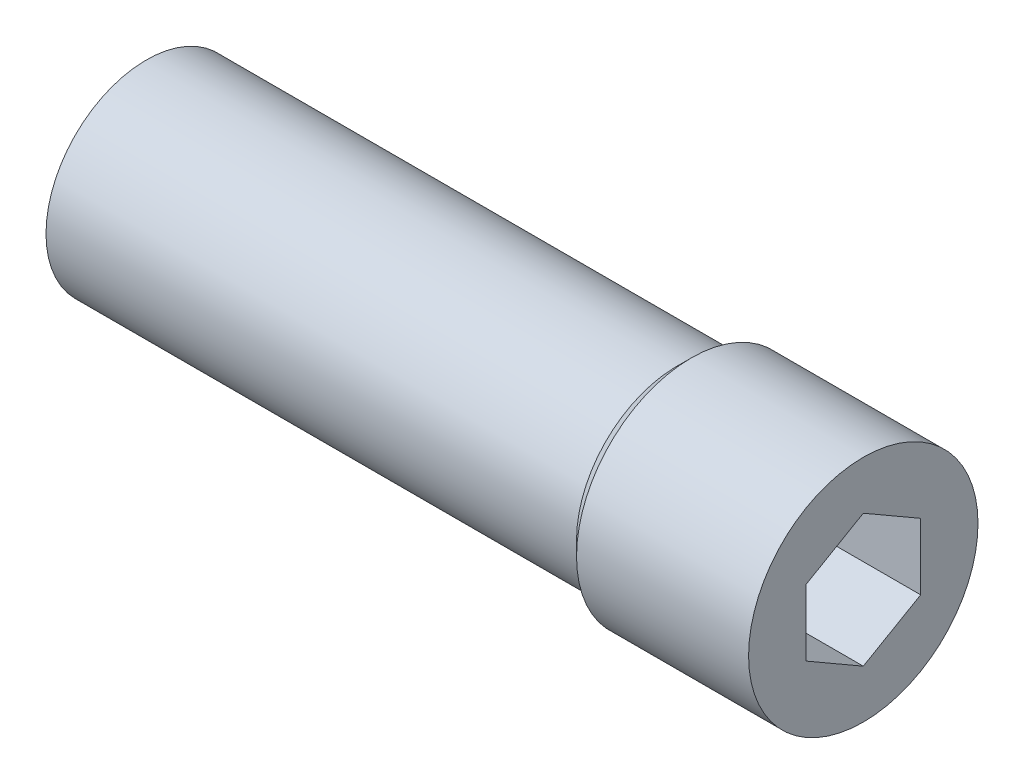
ISO-10303-21;
HEADER;
FILE_DESCRIPTION(('STEP AP214'),'2;1');
FILE_NAME('part.step','',(''),(''),'','','');
FILE_SCHEMA(('AUTOMOTIVE_DESIGN { 1 0 10303 214 1 1 1 1 }'));
ENDSEC;
DATA;
#1=APPLICATION_CONTEXT('core data for automotive mechanical design processes');
#2=APPLICATION_PROTOCOL_DEFINITION('international standard','automotive_design',2000,#1);
#3=PRODUCT_CONTEXT('',#1,'mechanical');
#4=PRODUCT('Part','Part','',(#3));
#5=PRODUCT_RELATED_PRODUCT_CATEGORY('part','',(#4));
#6=PRODUCT_DEFINITION_FORMATION('','',#4);
#7=PRODUCT_DEFINITION_CONTEXT('part definition',#1,'design');
#8=PRODUCT_DEFINITION('design','',#6,#7);
#9=PRODUCT_DEFINITION_SHAPE('','',#8);
#10=(LENGTH_UNIT() NAMED_UNIT(*) SI_UNIT(.MILLI.,.METRE.));
#11=(NAMED_UNIT(*) PLANE_ANGLE_UNIT() SI_UNIT($,.RADIAN.));
#12=(NAMED_UNIT(*) SI_UNIT($,.STERADIAN.) SOLID_ANGLE_UNIT());
#13=UNCERTAINTY_MEASURE_WITH_UNIT(LENGTH_MEASURE(1.E-05),#10,'distance_accuracy_value','');
#14=(GEOMETRIC_REPRESENTATION_CONTEXT(3) GLOBAL_UNCERTAINTY_ASSIGNED_CONTEXT((#13)) GLOBAL_UNIT_ASSIGNED_CONTEXT((#10,
#11,#12)) REPRESENTATION_CONTEXT('',''));
#15=CARTESIAN_POINT('',(0.,0.,0.));
#16=DIRECTION('',(0.,0.,1.));
#17=DIRECTION('',(1.,0.,0.));
#18=AXIS2_PLACEMENT_3D('',#15,#16,#17);
#19=CARTESIAN_POINT('',(0.,0.,0.));
#20=DIRECTION('',(1.,0.,0.));
#21=DIRECTION('',(0.,0.,-1.));
#22=AXIS2_PLACEMENT_3D('',#19,#20,#21);
#23=PLANE('',#22);
#24=CARTESIAN_POINT('',(0.,0.,0.));
#25=DIRECTION('',(-1.,0.,0.));
#26=DIRECTION('',(0.,0.,1.));
#27=AXIS2_PLACEMENT_3D('',#24,#25,#26);
#28=CIRCLE('',#27,7.);
#29=CARTESIAN_POINT('',(0.,0.,7.));
#30=VERTEX_POINT('',#29);
#31=EDGE_CURVE('E10',#30,#30,#28,.T.);
#32=ORIENTED_EDGE('',*,*,#31,.T.);
#33=EDGE_LOOP('',(#32));
#34=FACE_BOUND('',#33,.T.);
#35=ADVANCED_FACE('F16',(#34),#23,.F.);
#36=CARTESIAN_POINT('',(0.,0.,0.));
#37=DIRECTION('',(-1.,0.,0.));
#38=DIRECTION('',(0.,0.,1.));
#39=AXIS2_PLACEMENT_3D('',#36,#37,#38);
#40=CYLINDRICAL_SURFACE('',#39,7.);
#41=ORIENTED_EDGE('',*,*,#31,.F.);
#42=EDGE_LOOP('',(#41));
#43=FACE_BOUND('',#42,.T.);
#44=CARTESIAN_POINT('',(37.,0.,0.));
#45=DIRECTION('',(-1.,0.,0.));
#46=DIRECTION('',(0.,0.,1.));
#47=AXIS2_PLACEMENT_3D('',#44,#45,#46);
#48=CIRCLE('',#47,7.);
#49=CARTESIAN_POINT('',(37.,0.,7.));
#50=VERTEX_POINT('',#49);
#51=EDGE_CURVE('E23',#50,#50,#48,.T.);
#52=ORIENTED_EDGE('',*,*,#51,.T.);
#53=EDGE_LOOP('',(#52));
#54=FACE_BOUND('',#53,.T.);
#55=ADVANCED_FACE('F130',(#43,#54),#40,.T.);
#56=CARTESIAN_POINT('',(38.,0.,0.));
#57=DIRECTION('',(1.,0.,0.));
#58=DIRECTION('',(0.,0.,-1.));
#59=AXIS2_PLACEMENT_3D('',#56,#57,#58);
#60=CONICAL_SURFACE('',#59,8.,0.785398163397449);
#61=ORIENTED_EDGE('',*,*,#51,.F.);
#62=EDGE_LOOP('',(#61));
#63=FACE_BOUND('',#62,.T.);
#64=CARTESIAN_POINT('',(38.,0.,0.));
#65=DIRECTION('',(-1.,0.,0.));
#66=DIRECTION('',(0.,0.,1.));
#67=AXIS2_PLACEMENT_3D('',#64,#65,#66);
#68=CIRCLE('',#67,8.);
#69=CARTESIAN_POINT('',(38.,0.,8.));
#70=VERTEX_POINT('',#69);
#71=EDGE_CURVE('E125',#70,#70,#68,.T.);
#72=ORIENTED_EDGE('',*,*,#71,.T.);
#73=EDGE_LOOP('',(#72));
#74=FACE_BOUND('',#73,.T.);
#75=ADVANCED_FACE('F132',(#63,#74),#60,.T.);
#76=CARTESIAN_POINT('',(0.,0.,0.));
#77=DIRECTION('',(-1.,0.,0.));
#78=DIRECTION('',(0.,0.,1.));
#79=AXIS2_PLACEMENT_3D('',#76,#77,#78);
#80=CYLINDRICAL_SURFACE('',#79,8.);
#81=ORIENTED_EDGE('',*,*,#71,.F.);
#82=EDGE_LOOP('',(#81));
#83=FACE_BOUND('',#82,.T.);
#84=CARTESIAN_POINT('',(50.,0.,0.));
#85=DIRECTION('',(-1.,0.,0.));
#86=DIRECTION('',(0.,0.,1.));
#87=AXIS2_PLACEMENT_3D('',#84,#85,#86);
#88=CIRCLE('',#87,8.);
#89=CARTESIAN_POINT('',(50.,0.,8.));
#90=VERTEX_POINT('',#89);
#91=EDGE_CURVE('E117',#90,#90,#88,.T.);
#92=ORIENTED_EDGE('',*,*,#91,.T.);
#93=EDGE_LOOP('',(#92));
#94=FACE_BOUND('',#93,.T.);
#95=ADVANCED_FACE('F135',(#83,#94),#80,.T.);
#96=CARTESIAN_POINT('',(50.,8.,0.));
#97=DIRECTION('',(-1.,0.,0.));
#98=DIRECTION('',(0.,0.,1.));
#99=AXIS2_PLACEMENT_3D('',#96,#97,#98);
#100=PLANE('',#99);
#101=DIRECTION('',(0.,-0.5,0.866025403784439));
#102=VECTOR('',#101,1.);
#103=CARTESIAN_POINT('',(50.,4.61880215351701,0.));
#104=LINE('',#103,#102);
#105=CARTESIAN_POINT('',(50.,4.61880215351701,0.));
#106=VERTEX_POINT('',#105);
#107=CARTESIAN_POINT('',(50.,2.30940107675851,4.));
#108=VERTEX_POINT('',#107);
#109=EDGE_CURVE('E104',#106,#108,#104,.T.);
#110=ORIENTED_EDGE('',*,*,#109,.F.);
#111=DIRECTION('',(0.,0.5,0.866025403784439));
#112=VECTOR('',#111,1.);
#113=CARTESIAN_POINT('',(50.,2.30940107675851,-4.));
#114=LINE('',#113,#112);
#115=CARTESIAN_POINT('',(50.,2.30940107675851,-4.));
#116=VERTEX_POINT('',#115);
#117=EDGE_CURVE('E30',#116,#106,#114,.T.);
#118=ORIENTED_EDGE('',*,*,#117,.F.);
#119=DIRECTION('',(0.,1.,0.));
#120=VECTOR('',#119,1.);
#121=CARTESIAN_POINT('',(50.,-2.30940107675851,-4.));
#122=LINE('',#121,#120);
#123=CARTESIAN_POINT('',(50.,-2.30940107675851,-4.));
#124=VERTEX_POINT('',#123);
#125=EDGE_CURVE('E113',#124,#116,#122,.T.);
#126=ORIENTED_EDGE('',*,*,#125,.F.);
#127=DIRECTION('',(0.,0.5,-0.866025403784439));
#128=VECTOR('',#127,1.);
#129=CARTESIAN_POINT('',(50.,-4.61880215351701,0.));
#130=LINE('',#129,#128);
#131=CARTESIAN_POINT('',(50.,-4.61880215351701,0.));
#132=VERTEX_POINT('',#131);
#133=EDGE_CURVE('E111',#132,#124,#130,.T.);
#134=ORIENTED_EDGE('',*,*,#133,.F.);
#135=DIRECTION('',(0.,-0.5,-0.866025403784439));
#136=VECTOR('',#135,1.);
#137=CARTESIAN_POINT('',(50.,-2.30940107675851,4.));
#138=LINE('',#137,#136);
#139=CARTESIAN_POINT('',(50.,-2.30940107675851,4.));
#140=VERTEX_POINT('',#139);
#141=EDGE_CURVE('E78',#140,#132,#138,.T.);
#142=ORIENTED_EDGE('',*,*,#141,.F.);
#143=DIRECTION('',(0.,-1.,0.));
#144=VECTOR('',#143,1.);
#145=CARTESIAN_POINT('',(50.,2.30940107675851,4.));
#146=LINE('',#145,#144);
#147=EDGE_CURVE('E107',#108,#140,#146,.T.);
#148=ORIENTED_EDGE('',*,*,#147,.F.);
#149=EDGE_LOOP('',(#110,#118,#126,#134,#142,#148));
#150=FACE_BOUND('',#149,.T.);
#151=ORIENTED_EDGE('',*,*,#91,.F.);
#152=EDGE_LOOP('',(#151));
#153=FACE_BOUND('',#152,.T.);
#154=ADVANCED_FACE('F141',(#150,#153),#100,.F.);
#155=CARTESIAN_POINT('',(40.,2.30940107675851,-4.));
#156=DIRECTION('',(0.,0.866025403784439,-0.5));
#157=DIRECTION('',(0.,0.5,0.866025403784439));
#158=AXIS2_PLACEMENT_3D('',#155,#156,#157);
#159=PLANE('',#158);
#160=ORIENTED_EDGE('',*,*,#117,.T.);
#161=DIRECTION('',(1.,0.,0.));
#162=VECTOR('',#161,1.);
#163=CARTESIAN_POINT('',(40.,4.61880215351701,0.));
#164=LINE('',#163,#162);
#165=CARTESIAN_POINT('',(40.,4.61880215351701,0.));
#166=VERTEX_POINT('',#165);
#167=EDGE_CURVE('E60',#166,#106,#164,.T.);
#168=ORIENTED_EDGE('',*,*,#167,.F.);
#169=DIRECTION('',(0.,0.5,0.866025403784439));
#170=VECTOR('',#169,1.);
#171=CARTESIAN_POINT('',(40.,2.30940107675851,-4.));
#172=LINE('',#171,#170);
#173=CARTESIAN_POINT('',(40.,2.30940107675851,-4.));
#174=VERTEX_POINT('',#173);
#175=EDGE_CURVE('E115',#174,#166,#172,.T.);
#176=ORIENTED_EDGE('',*,*,#175,.F.);
#177=DIRECTION('',(1.,0.,0.));
#178=VECTOR('',#177,1.);
#179=CARTESIAN_POINT('',(40.,2.30940107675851,-4.));
#180=LINE('',#179,#178);
#181=EDGE_CURVE('E38',#174,#116,#180,.T.);
#182=ORIENTED_EDGE('',*,*,#181,.T.);
#183=EDGE_LOOP('',(#160,#168,#176,#182));
#184=FACE_BOUND('',#183,.T.);
#185=ADVANCED_FACE('F146',(#184),#159,.F.);
#186=CARTESIAN_POINT('',(40.,-2.30940107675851,-4.));
#187=DIRECTION('',(0.,0.,-1.));
#188=DIRECTION('',(-1.,0.,0.));
#189=AXIS2_PLACEMENT_3D('',#186,#187,#188);
#190=PLANE('',#189);
#191=ORIENTED_EDGE('',*,*,#125,.T.);
#192=ORIENTED_EDGE('',*,*,#181,.F.);
#193=DIRECTION('',(0.,1.,0.));
#194=VECTOR('',#193,1.);
#195=CARTESIAN_POINT('',(40.,-2.30940107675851,-4.));
#196=LINE('',#195,#194);
#197=CARTESIAN_POINT('',(40.,-2.30940107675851,-4.));
#198=VERTEX_POINT('',#197);
#199=EDGE_CURVE('E90',#198,#174,#196,.T.);
#200=ORIENTED_EDGE('',*,*,#199,.F.);
#201=DIRECTION('',(1.,0.,0.));
#202=VECTOR('',#201,1.);
#203=CARTESIAN_POINT('',(40.,-2.30940107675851,-4.));
#204=LINE('',#203,#202);
#205=EDGE_CURVE('E82',#198,#124,#204,.T.);
#206=ORIENTED_EDGE('',*,*,#205,.T.);
#207=EDGE_LOOP('',(#191,#192,#200,#206));
#208=FACE_BOUND('',#207,.T.);
#209=ADVANCED_FACE('F154',(#208),#190,.F.);
#210=CARTESIAN_POINT('',(40.,-4.61880215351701,0.));
#211=DIRECTION('',(0.,-0.866025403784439,-0.5));
#212=DIRECTION('',(0.,0.5,-0.866025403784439));
#213=AXIS2_PLACEMENT_3D('',#210,#211,#212);
#214=PLANE('',#213);
#215=ORIENTED_EDGE('',*,*,#133,.T.);
#216=ORIENTED_EDGE('',*,*,#205,.F.);
#217=DIRECTION('',(0.,0.5,-0.866025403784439));
#218=VECTOR('',#217,1.);
#219=CARTESIAN_POINT('',(40.,-4.61880215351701,0.));
#220=LINE('',#219,#218);
#221=CARTESIAN_POINT('',(40.,-4.61880215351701,0.));
#222=VERTEX_POINT('',#221);
#223=EDGE_CURVE('E86',#222,#198,#220,.T.);
#224=ORIENTED_EDGE('',*,*,#223,.F.);
#225=DIRECTION('',(1.,0.,0.));
#226=VECTOR('',#225,1.);
#227=CARTESIAN_POINT('',(40.,-4.61880215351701,0.));
#228=LINE('',#227,#226);
#229=EDGE_CURVE('E71',#222,#132,#228,.T.);
#230=ORIENTED_EDGE('',*,*,#229,.T.);
#231=EDGE_LOOP('',(#215,#216,#224,#230));
#232=FACE_BOUND('',#231,.T.);
#233=ADVANCED_FACE('F87',(#232),#214,.F.);
#234=CARTESIAN_POINT('',(40.,-2.30940107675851,4.));
#235=DIRECTION('',(0.,-0.866025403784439,0.5));
#236=DIRECTION('',(0.,-0.5,-0.866025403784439));
#237=AXIS2_PLACEMENT_3D('',#234,#235,#236);
#238=PLANE('',#237);
#239=ORIENTED_EDGE('',*,*,#141,.T.);
#240=ORIENTED_EDGE('',*,*,#229,.F.);
#241=DIRECTION('',(0.,-0.5,-0.866025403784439));
#242=VECTOR('',#241,1.);
#243=CARTESIAN_POINT('',(40.,-2.30940107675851,4.));
#244=LINE('',#243,#242);
#245=CARTESIAN_POINT('',(40.,-2.30940107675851,4.));
#246=VERTEX_POINT('',#245);
#247=EDGE_CURVE('E75',#246,#222,#244,.T.);
#248=ORIENTED_EDGE('',*,*,#247,.F.);
#249=DIRECTION('',(1.,0.,0.));
#250=VECTOR('',#249,1.);
#251=CARTESIAN_POINT('',(40.,-2.30940107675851,4.));
#252=LINE('',#251,#250);
#253=EDGE_CURVE('E83',#246,#140,#252,.T.);
#254=ORIENTED_EDGE('',*,*,#253,.T.);
#255=EDGE_LOOP('',(#239,#240,#248,#254));
#256=FACE_BOUND('',#255,.T.);
#257=ADVANCED_FACE('F73',(#256),#238,.F.);
#258=CARTESIAN_POINT('',(40.,2.30940107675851,4.));
#259=DIRECTION('',(0.,0.,1.));
#260=DIRECTION('',(1.,0.,0.));
#261=AXIS2_PLACEMENT_3D('',#258,#259,#260);
#262=PLANE('',#261);
#263=ORIENTED_EDGE('',*,*,#147,.T.);
#264=ORIENTED_EDGE('',*,*,#253,.F.);
#265=DIRECTION('',(0.,-1.,0.));
#266=VECTOR('',#265,1.);
#267=CARTESIAN_POINT('',(40.,2.30940107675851,4.));
#268=LINE('',#267,#266);
#269=CARTESIAN_POINT('',(40.,2.30940107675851,4.));
#270=VERTEX_POINT('',#269);
#271=EDGE_CURVE('E96',#270,#246,#268,.T.);
#272=ORIENTED_EDGE('',*,*,#271,.F.);
#273=DIRECTION('',(1.,0.,0.));
#274=VECTOR('',#273,1.);
#275=CARTESIAN_POINT('',(40.,2.30940107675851,4.));
#276=LINE('',#275,#274);
#277=EDGE_CURVE('E120',#270,#108,#276,.T.);
#278=ORIENTED_EDGE('',*,*,#277,.T.);
#279=EDGE_LOOP('',(#263,#264,#272,#278));
#280=FACE_BOUND('',#279,.T.);
#281=ADVANCED_FACE('F221',(#280),#262,.F.);
#282=CARTESIAN_POINT('',(40.,4.61880215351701,0.));
#283=DIRECTION('',(0.,0.866025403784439,0.5));
#284=DIRECTION('',(0.,-0.5,0.866025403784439));
#285=AXIS2_PLACEMENT_3D('',#282,#283,#284);
#286=PLANE('',#285);
#287=ORIENTED_EDGE('',*,*,#109,.T.);
#288=ORIENTED_EDGE('',*,*,#277,.F.);
#289=DIRECTION('',(0.,-0.5,0.866025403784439));
#290=VECTOR('',#289,1.);
#291=CARTESIAN_POINT('',(40.,4.61880215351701,0.));
#292=LINE('',#291,#290);
#293=EDGE_CURVE('E98',#166,#270,#292,.T.);
#294=ORIENTED_EDGE('',*,*,#293,.F.);
#295=ORIENTED_EDGE('',*,*,#167,.T.);
#296=EDGE_LOOP('',(#287,#288,#294,#295));
#297=FACE_BOUND('',#296,.T.);
#298=ADVANCED_FACE('F229',(#297),#286,.F.);
#299=CARTESIAN_POINT('',(40.,0.,0.));
#300=DIRECTION('',(1.,0.,0.));
#301=DIRECTION('',(0.,0.,-1.));
#302=AXIS2_PLACEMENT_3D('',#299,#300,#301);
#303=PLANE('',#302);
#304=ORIENTED_EDGE('',*,*,#175,.T.);
#305=ORIENTED_EDGE('',*,*,#293,.T.);
#306=ORIENTED_EDGE('',*,*,#271,.T.);
#307=ORIENTED_EDGE('',*,*,#247,.T.);
#308=ORIENTED_EDGE('',*,*,#223,.T.);
#309=ORIENTED_EDGE('',*,*,#199,.T.);
#310=EDGE_LOOP('',(#304,#305,#306,#307,#308,#309));
#311=FACE_BOUND('',#310,.T.);
#312=ADVANCED_FACE('F93',(#311),#303,.T.);
#313=CLOSED_SHELL('',(#35,#55,#75,#95,#154,#185,#209,#233,#257,#281,#298,#312));
#314=MANIFOLD_SOLID_BREP('B1',#313);
#315=ADVANCED_BREP_SHAPE_REPRESENTATION('',(#18,#314),#14);
#316=SHAPE_DEFINITION_REPRESENTATION(#9,#315);
ENDSEC;
END-ISO-10303-21;
